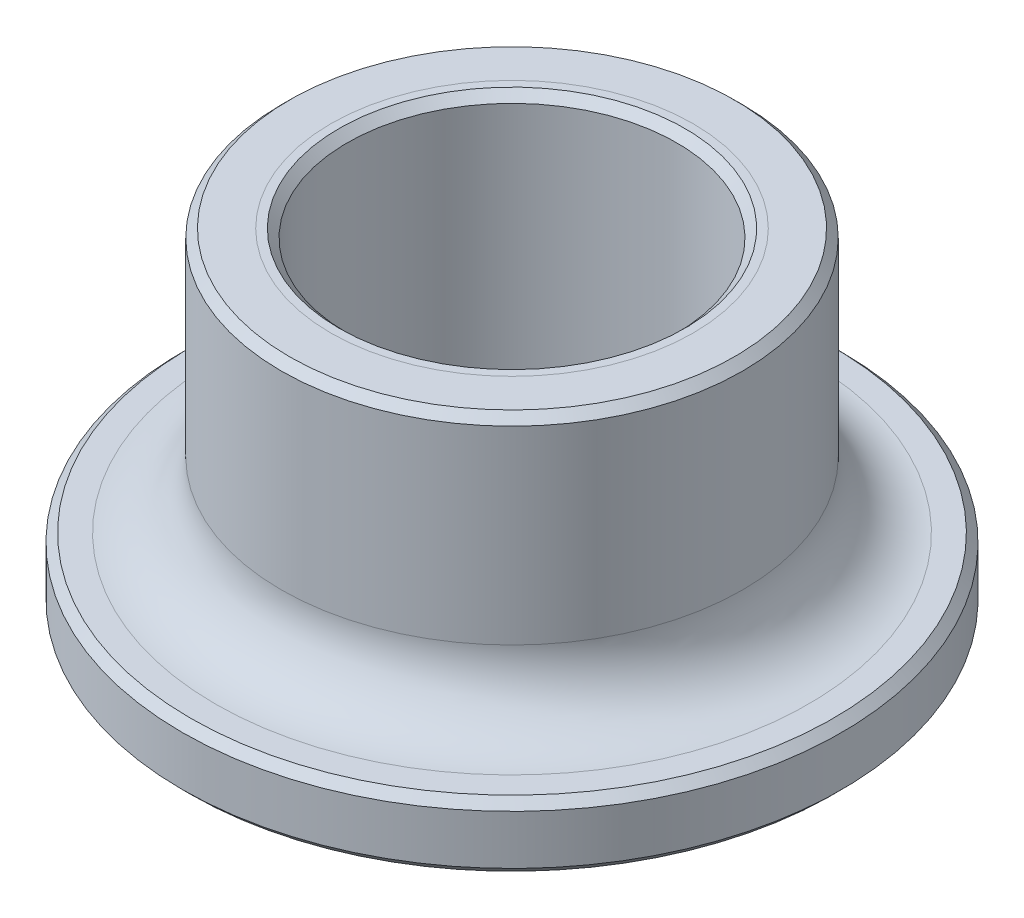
from build123d import *

# Parameters (mm, degrees)
SKETCH1_R           = 10
BOSS_EXTRUDE1_DEPTH = 2
SKETCH2_R           = 7
BOSS_EXTRUDE2_DEPTH = 8
SKETCH3_R           = 5
CUT_EXTRUDE1_DEPTH  = 18.320508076
CHAMFER1_SIZE       = 0.25
FILLET1_R           = 2


with BuildPart() as part:
    # Sketch1 → Boss-Extrude1 (new body)
    with BuildSketch(Plane(origin=(0, 0, 0), x_dir=(1, 0, 0), z_dir=(0, 1, 0))):
        with Locations(Location((0, 0, 0), (0, 0, 270))):
            Circle(SKETCH1_R)
    extrude(amount=BOSS_EXTRUDE1_DEPTH)

    # Sketch2 → Boss-Extrude2 (add)
    with BuildSketch(Plane(origin=(0, 2, 0), x_dir=(1, 0, 0), z_dir=(0, 1, 0))):
        with Locations(Location((0, 0, 0), (0, 0, 270))):
            Circle(SKETCH2_R)
    extrude(amount=BOSS_EXTRUDE2_DEPTH)

    # Sketch3 → Cut-Extrude1 (cut, through all)
    with BuildSketch(Plane(origin=(0, 10, 0), x_dir=(1, 0, 0), z_dir=(0, 1, 0))):
        with Locations(Location((0, 0, 0), (0, 0, 270))):
            Circle(SKETCH3_R)
    extrude(amount=-CUT_EXTRUDE1_DEPTH, mode=Mode.SUBTRACT)

    # Chamfer1
    chamfer1_edges = [part.edges().sort_by_distance(p)[0] for p in [
        (0, 0, -5),
        (0, 10, -5),
        (0, 0, -10),
        (0, 2, -10),
        (0, 10, -7),
    ]]
    chamfer(chamfer1_edges, length=CHAMFER1_SIZE)

    # Fillet1
    fillet1_edges = [part.edges().sort_by_distance(p)[0] for p in [
        (0, 2, -7),
    ]]
    fillet(fillet1_edges, radius=FILLET1_R)


solid = part.part
